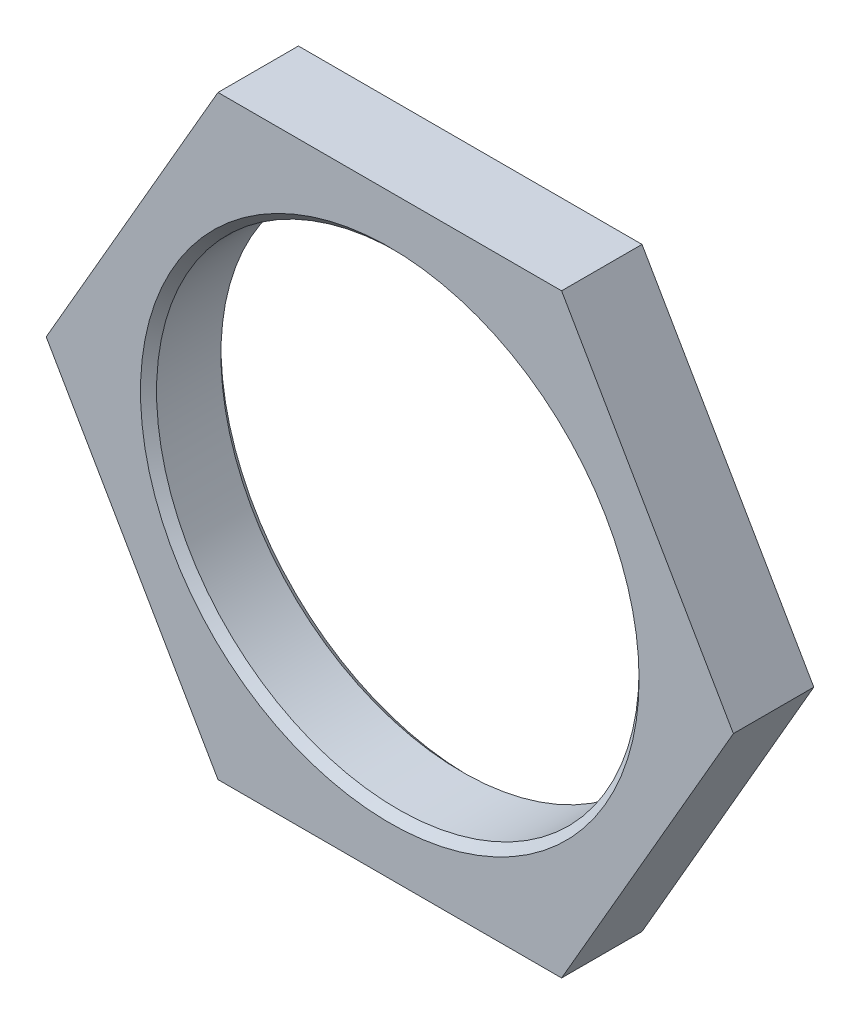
from build123d import *

# Parameters (mm, degrees)
BASE_EXTRUSION_DEPTH    = 1
ESQUISSE2_R             = 3
ENL_V_MAT_EXTRU_1_DEPTH = 6.739628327
CHANFREIN1_SIZE         = 0.1


with BuildPart() as part:
    # Esquisse1 → Base-Extrusion (new body)
    with BuildSketch(Plane.XY):
        Polygon((-2.136195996, 3.7), (2.136195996, 3.7), (4.272391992, 0), (2.136195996, -3.7), (-2.136195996, -3.7), (-4.272391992, 0), align=None)
    extrude(amount=BASE_EXTRUSION_DEPTH)

    # Esquisse2 → Enl_v. mat.-Extru.1 (cut, through all)
    with BuildSketch(Plane.XY.offset(1)):
        Circle(ESQUISSE2_R)
    extrude(amount=-ENL_V_MAT_EXTRU_1_DEPTH, mode=Mode.SUBTRACT)

    # Chanfrein1
    chanfrein1_edges = [part.edges().sort_by_distance(p)[0] for p in [
        (-3, 0, 0),
        (-3, 0, 1),
    ]]
    chamfer(chanfrein1_edges, length=CHANFREIN1_SIZE)


solid = part.part
